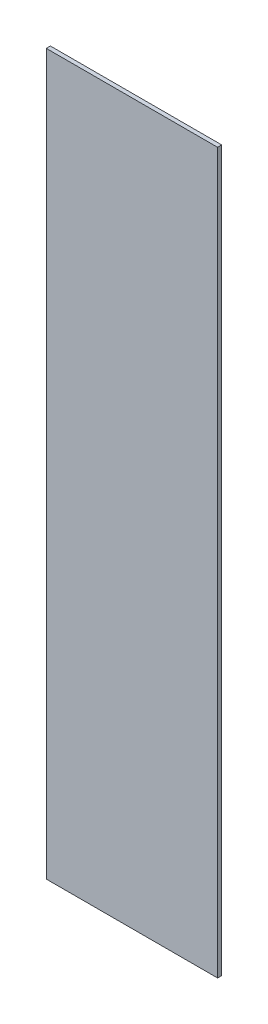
ISO-10303-21;
HEADER;
FILE_DESCRIPTION(('STEP AP214'),'2;1');
FILE_NAME('part.step','',(''),(''),'','','');
FILE_SCHEMA(('AUTOMOTIVE_DESIGN { 1 0 10303 214 1 1 1 1 }'));
ENDSEC;
DATA;
#1=APPLICATION_CONTEXT('core data for automotive mechanical design processes');
#2=APPLICATION_PROTOCOL_DEFINITION('international standard','automotive_design',2000,#1);
#3=PRODUCT_CONTEXT('',#1,'mechanical');
#4=PRODUCT('Part','Part','',(#3));
#5=PRODUCT_RELATED_PRODUCT_CATEGORY('part','',(#4));
#6=PRODUCT_DEFINITION_FORMATION('','',#4);
#7=PRODUCT_DEFINITION_CONTEXT('part definition',#1,'design');
#8=PRODUCT_DEFINITION('design','',#6,#7);
#9=PRODUCT_DEFINITION_SHAPE('','',#8);
#10=(LENGTH_UNIT() NAMED_UNIT(*) SI_UNIT(.MILLI.,.METRE.));
#11=(NAMED_UNIT(*) PLANE_ANGLE_UNIT() SI_UNIT($,.RADIAN.));
#12=(NAMED_UNIT(*) SI_UNIT($,.STERADIAN.) SOLID_ANGLE_UNIT());
#13=UNCERTAINTY_MEASURE_WITH_UNIT(LENGTH_MEASURE(1.E-05),#10,'distance_accuracy_value','');
#14=(GEOMETRIC_REPRESENTATION_CONTEXT(3) GLOBAL_UNCERTAINTY_ASSIGNED_CONTEXT((#13)) GLOBAL_UNIT_ASSIGNED_CONTEXT((#10,
#11,#12)) REPRESENTATION_CONTEXT('',''));
#15=CARTESIAN_POINT('',(0.,0.,0.));
#16=DIRECTION('',(0.,0.,1.));
#17=DIRECTION('',(1.,0.,0.));
#18=AXIS2_PLACEMENT_3D('',#15,#16,#17);
#19=CARTESIAN_POINT('',(0.,0.,6.));
#20=DIRECTION('',(1.,0.,0.));
#21=DIRECTION('',(0.,0.,-1.));
#22=AXIS2_PLACEMENT_3D('',#19,#20,#21);
#23=PLANE('',#22);
#24=DIRECTION('',(0.,-1.,0.));
#25=VECTOR('',#24,1.);
#26=CARTESIAN_POINT('',(0.,0.,0.));
#27=LINE('',#26,#25);
#28=CARTESIAN_POINT('',(0.,1050.,0.));
#29=VERTEX_POINT('',#28);
#30=CARTESIAN_POINT('',(0.,0.,0.));
#31=VERTEX_POINT('',#30);
#32=EDGE_CURVE('E113',#29,#31,#27,.T.);
#33=ORIENTED_EDGE('',*,*,#32,.T.);
#34=DIRECTION('',(0.,0.,-1.));
#35=VECTOR('',#34,1.);
#36=CARTESIAN_POINT('',(0.,0.,6.));
#37=LINE('',#36,#35);
#38=CARTESIAN_POINT('',(0.,0.,6.));
#39=VERTEX_POINT('',#38);
#40=EDGE_CURVE('E11',#39,#31,#37,.T.);
#41=ORIENTED_EDGE('',*,*,#40,.F.);
#42=DIRECTION('',(0.,-1.,0.));
#43=VECTOR('',#42,1.);
#44=CARTESIAN_POINT('',(0.,0.,6.));
#45=LINE('',#44,#43);
#46=CARTESIAN_POINT('',(0.,1050.,6.));
#47=VERTEX_POINT('',#46);
#48=EDGE_CURVE('E97',#47,#39,#45,.T.);
#49=ORIENTED_EDGE('',*,*,#48,.F.);
#50=DIRECTION('',(0.,0.,-1.));
#51=VECTOR('',#50,1.);
#52=CARTESIAN_POINT('',(0.,1050.,6.));
#53=LINE('',#52,#51);
#54=EDGE_CURVE('E109',#47,#29,#53,.T.);
#55=ORIENTED_EDGE('',*,*,#54,.T.);
#56=EDGE_LOOP('',(#33,#41,#49,#55));
#57=FACE_BOUND('',#56,.T.);
#58=ADVANCED_FACE('F45',(#57),#23,.F.);
#59=CARTESIAN_POINT('',(0.,0.,6.));
#60=DIRECTION('',(0.,1.,0.));
#61=DIRECTION('',(0.,0.,1.));
#62=AXIS2_PLACEMENT_3D('',#59,#60,#61);
#63=PLANE('',#62);
#64=DIRECTION('',(1.,0.,0.));
#65=VECTOR('',#64,1.);
#66=CARTESIAN_POINT('',(0.,0.,0.));
#67=LINE('',#66,#65);
#68=CARTESIAN_POINT('',(250.,0.,0.));
#69=VERTEX_POINT('',#68);
#70=EDGE_CURVE('E102',#31,#69,#67,.T.);
#71=ORIENTED_EDGE('',*,*,#70,.T.);
#72=DIRECTION('',(0.,0.,-1.));
#73=VECTOR('',#72,1.);
#74=CARTESIAN_POINT('',(250.,0.,6.));
#75=LINE('',#74,#73);
#76=CARTESIAN_POINT('',(250.,0.,6.));
#77=VERTEX_POINT('',#76);
#78=EDGE_CURVE('E54',#77,#69,#75,.T.);
#79=ORIENTED_EDGE('',*,*,#78,.F.);
#80=DIRECTION('',(1.,0.,0.));
#81=VECTOR('',#80,1.);
#82=CARTESIAN_POINT('',(0.,0.,6.));
#83=LINE('',#82,#81);
#84=EDGE_CURVE('E92',#39,#77,#83,.T.);
#85=ORIENTED_EDGE('',*,*,#84,.F.);
#86=ORIENTED_EDGE('',*,*,#40,.T.);
#87=EDGE_LOOP('',(#71,#79,#85,#86));
#88=FACE_BOUND('',#87,.T.);
#89=ADVANCED_FACE('F101',(#88),#63,.F.);
#90=CARTESIAN_POINT('',(250.,0.,6.));
#91=DIRECTION('',(-1.,0.,0.));
#92=DIRECTION('',(0.,0.,1.));
#93=AXIS2_PLACEMENT_3D('',#90,#91,#92);
#94=PLANE('',#93);
#95=DIRECTION('',(0.,1.,0.));
#96=VECTOR('',#95,1.);
#97=CARTESIAN_POINT('',(250.,0.,0.));
#98=LINE('',#97,#96);
#99=CARTESIAN_POINT('',(250.,1050.,0.));
#100=VERTEX_POINT('',#99);
#101=EDGE_CURVE('E79',#69,#100,#98,.T.);
#102=ORIENTED_EDGE('',*,*,#101,.T.);
#103=DIRECTION('',(0.,0.,-1.));
#104=VECTOR('',#103,1.);
#105=CARTESIAN_POINT('',(250.,1050.,6.));
#106=LINE('',#105,#104);
#107=CARTESIAN_POINT('',(250.,1050.,6.));
#108=VERTEX_POINT('',#107);
#109=EDGE_CURVE('E104',#108,#100,#106,.T.);
#110=ORIENTED_EDGE('',*,*,#109,.F.);
#111=DIRECTION('',(0.,1.,0.));
#112=VECTOR('',#111,1.);
#113=CARTESIAN_POINT('',(250.,0.,6.));
#114=LINE('',#113,#112);
#115=EDGE_CURVE('E95',#77,#108,#114,.T.);
#116=ORIENTED_EDGE('',*,*,#115,.F.);
#117=ORIENTED_EDGE('',*,*,#78,.T.);
#118=EDGE_LOOP('',(#102,#110,#116,#117));
#119=FACE_BOUND('',#118,.T.);
#120=ADVANCED_FACE('F105',(#119),#94,.F.);
#121=CARTESIAN_POINT('',(0.,1050.,6.));
#122=DIRECTION('',(0.,-1.,0.));
#123=DIRECTION('',(0.,0.,-1.));
#124=AXIS2_PLACEMENT_3D('',#121,#122,#123);
#125=PLANE('',#124);
#126=DIRECTION('',(-1.,0.,0.));
#127=VECTOR('',#126,1.);
#128=CARTESIAN_POINT('',(0.,1050.,0.));
#129=LINE('',#128,#127);
#130=EDGE_CURVE('E85',#100,#29,#129,.T.);
#131=ORIENTED_EDGE('',*,*,#130,.T.);
#132=ORIENTED_EDGE('',*,*,#54,.F.);
#133=DIRECTION('',(-1.,0.,0.));
#134=VECTOR('',#133,1.);
#135=CARTESIAN_POINT('',(0.,1050.,6.));
#136=LINE('',#135,#134);
#137=EDGE_CURVE('E62',#108,#47,#136,.T.);
#138=ORIENTED_EDGE('',*,*,#137,.F.);
#139=ORIENTED_EDGE('',*,*,#109,.T.);
#140=EDGE_LOOP('',(#131,#132,#138,#139));
#141=FACE_BOUND('',#140,.T.);
#142=ADVANCED_FACE('F126',(#141),#125,.F.);
#143=CARTESIAN_POINT('',(0.,0.,6.));
#144=DIRECTION('',(0.,0.,-1.));
#145=DIRECTION('',(-1.,0.,0.));
#146=AXIS2_PLACEMENT_3D('',#143,#144,#145);
#147=PLANE('',#146);
#148=ORIENTED_EDGE('',*,*,#48,.T.);
#149=ORIENTED_EDGE('',*,*,#84,.T.);
#150=ORIENTED_EDGE('',*,*,#115,.T.);
#151=ORIENTED_EDGE('',*,*,#137,.T.);
#152=EDGE_LOOP('',(#148,#149,#150,#151));
#153=FACE_BOUND('',#152,.T.);
#154=ADVANCED_FACE('F93',(#153),#147,.F.);
#155=CARTESIAN_POINT('',(0.,0.,0.));
#156=DIRECTION('',(0.,0.,-1.));
#157=DIRECTION('',(-1.,0.,0.));
#158=AXIS2_PLACEMENT_3D('',#155,#156,#157);
#159=PLANE('',#158);
#160=ORIENTED_EDGE('',*,*,#32,.F.);
#161=ORIENTED_EDGE('',*,*,#130,.F.);
#162=ORIENTED_EDGE('',*,*,#101,.F.);
#163=ORIENTED_EDGE('',*,*,#70,.F.);
#164=EDGE_LOOP('',(#160,#161,#162,#163));
#165=FACE_BOUND('',#164,.T.);
#166=ADVANCED_FACE('F129',(#165),#159,.T.);
#167=CLOSED_SHELL('',(#58,#89,#120,#142,#154,#166));
#168=MANIFOLD_SOLID_BREP('B2',#167);
#169=ADVANCED_BREP_SHAPE_REPRESENTATION('',(#18,#168),#14);
#170=SHAPE_DEFINITION_REPRESENTATION(#9,#169);
ENDSEC;
END-ISO-10303-21;
